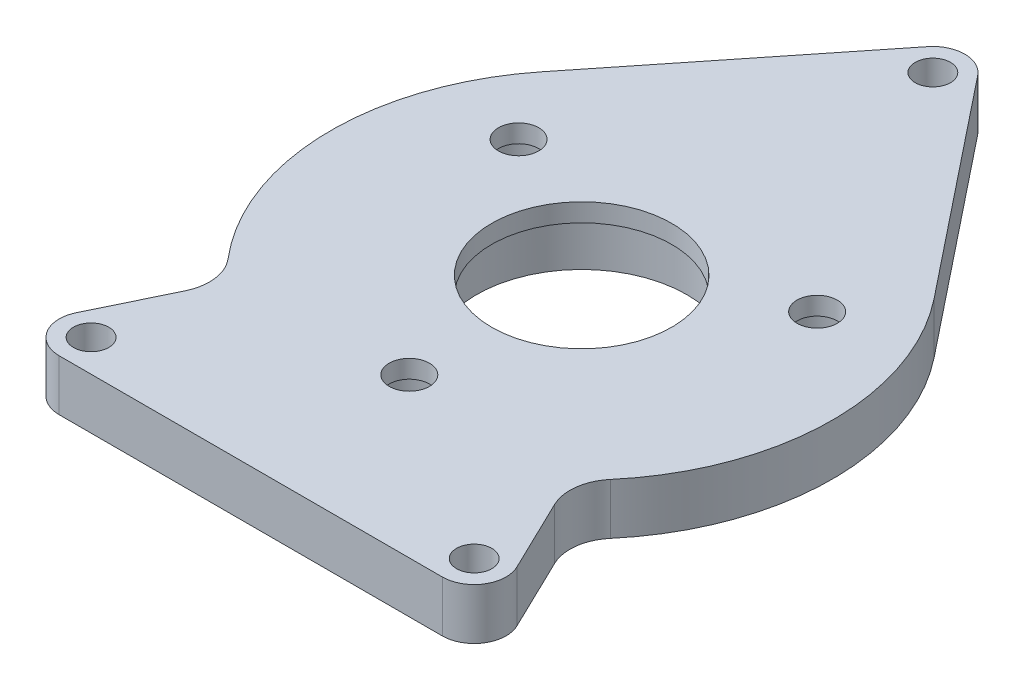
from build123d import *
from build123d.topology import SkipClean

# Parameters (mm, degrees)
SKETCH1_R                                       = 12.538100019
BOSS_EXTRUDE1_DEPTH                             = 7.112
BOSS_EXTRUDE2_START                             = 2.54
SKETCH9_R                                       = 19.0373
SKETCH9_R_2                                     = 12.538100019
BOSS_EXTRUDE2_DEPTH                             = 2.54
CBORE_FOR_10_BUTTON_HEAD_CAP_SCREW1_D           = 5.6134
CBORE_FOR_10_BUTTON_HEAD_CAP_SCREW1_CBORE_D     = 9.92124
CBORE_FOR_10_BUTTON_HEAD_CAP_SCREW1_CBORE_DEPTH = 7.1374
F_10_0_1935_DIAMETER_HOLE1_D                    = 4.9149
SKETCH10_R                                      = 14.6431
CUT_EXTRUDE1_DEPTH                              = 7.112


with BuildPart() as part:
    # Sketch1 → Boss-Extrude1 (new body)
    with BuildSketch(Plane(origin=(0, 0, 0), x_dir=(1, 0, 0), z_dir=(0, 1, 0))):
        with BuildLine():
            Line((-25.736378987, -29.489742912), (-30.672032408, -39.701187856))
            ThreePointArc((-30.672032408, -39.701187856), (-30.435386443, -43.99773028), (-26.67, -46.080551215))
            Line((-26.67, -46.080551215), (26.67, -46.080551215))
            ThreePointArc((26.67, -46.080551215), (30.435386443, -43.99773028), (30.672032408, -39.701187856))
            Line((30.672032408, -39.701187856), (25.736378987, -29.489742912))
            ThreePointArc((25.736378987, -29.489742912), (25.154744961, -25.921800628), (26.614557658, -22.614617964))
            ThreePointArc((26.614557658, -22.614617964), (34.920731, -0.546050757), (27.308616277, 21.771428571))
            Line((27.308616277, 21.771428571), (3.475642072, 51.665909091))
            ThreePointArc((3.475642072, 51.665909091), (0, 53.34), (-3.475642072, 51.665909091))
            Line((-3.475642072, 51.665909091), (-27.308616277, 21.771428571))
            ThreePointArc((-27.308616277, 21.771428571), (-34.920731, -0.546050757), (-26.614557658, -22.614617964))
            ThreePointArc((-26.614557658, -22.614617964), (-25.154744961, -25.921800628), (-25.736378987, -29.489742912))
        make_face()
        with Locations(Location((0, 0, 0), (0, 0, 270))):
            Circle(SKETCH1_R, mode=Mode.SUBTRACT)
    extrude(amount=BOSS_EXTRUDE1_DEPTH)

    # Sketch9 → Boss-Extrude2 (add)
    with SkipClean():  # the faces are left unmerged after this step: merging them gives an invalid solid
        with BuildSketch(Plane.XZ.offset(BOSS_EXTRUDE2_START)):
            with Locations(Location((0, 0, 0), (0, 0, 90))):
                Circle(SKETCH9_R)
            with Locations(Location((0, 0, 0), (0, 0, 270))):
                Circle(SKETCH9_R_2, mode=Mode.SUBTRACT)
        extrude(amount=-BOSS_EXTRUDE2_DEPTH)

    # CBORE for _10 Button Head Cap Screw1 (through all)
    with Locations(Plane(origin=(0, -2.54, 0), x_dir=(-1, 0, 0), z_dir=(0, -1, 0))):
        with Locations((-20.784609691, 12), (0, -24), (20.784609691, 12)):
            CounterBoreHole(CBORE_FOR_10_BUTTON_HEAD_CAP_SCREW1_D / 2, CBORE_FOR_10_BUTTON_HEAD_CAP_SCREW1_CBORE_D / 2, CBORE_FOR_10_BUTTON_HEAD_CAP_SCREW1_CBORE_DEPTH)

    # 10 _0.1935_ Diameter Hole1 (through all)
    with Locations(Plane(origin=(0, 7.112, 0), x_dir=(1, 0, 0), z_dir=(0, 1, 0))):
        with Locations((26.67, -41.635551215), (-26.67, -41.635551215), (0, 48.895)):
            Hole(F_10_0_1935_DIAMETER_HOLE1_D / 2)

    # Sketch10 → Cut-Extrude1 (cut)
    with BuildSketch(Plane.XZ.offset(2.54)):
        with Locations(Location((0, 0, 0), (0, 0, 270))):
            Circle(SKETCH10_R)
    extrude(amount=-CUT_EXTRUDE1_DEPTH, mode=Mode.SUBTRACT)


solid = part.part
